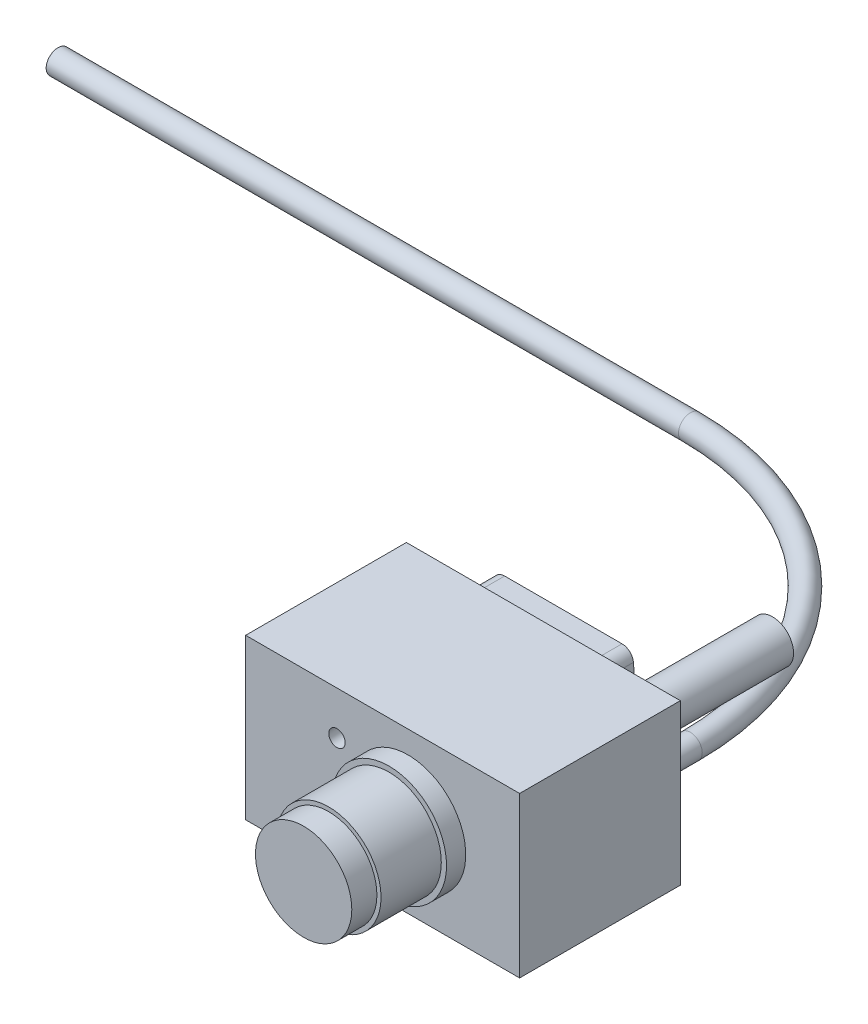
from build123d import *

# Parameters (mm, degrees)
SKETCH2_W           = 76.2
SKETCH2_H           = 44.704
BASE_EXTRUDE_DEPTH  = 22.225
SKETCH3_R           = 16.002
BOSS_EXTRUDE1_DEPTH = 5.334
SKETCH4_R           = 14.5415
BOSS_EXTRUDE2_DEPTH = 16.764
SKETCH6_R           = 13.3985
BOSS_EXTRUDE3_DEPTH = 6.985
BOSS_EXTRUDE4_DEPTH = 12.7
SKETCH15_R          = 6.35
EXTRUDE1_DEPTH      = 2.54
SKETCH8_R           = 3.302
SKETCH16_R          = 5.842
EXTRUDE2_DEPTH      = 35.56
SKETCH17_R          = 2.286
CUT_EXTRUDE1_DEPTH  = 12.7


with BuildPart() as part:
    # Sketch2 → Base-Extrude (new, symmetric)
    with BuildSketch(Plane(origin=(0, 0, 0), x_dir=(1, 0, 0), z_dir=(0, 1, 0))):
        Rectangle(SKETCH2_W, SKETCH2_H)
    extrude(amount=BASE_EXTRUDE_DEPTH, both=True)

    # Sketch3 → Boss-Extrude1 (add)
    with BuildSketch(Plane.XY.offset(22.352)):
        with Locations(Location((7.112, 0, 0), (0, 0, 180))):
            Circle(SKETCH3_R)
    extrude(amount=BOSS_EXTRUDE1_DEPTH)

    # Sketch4 → Boss-Extrude2 (add)
    with BuildSketch(Plane.XY.offset(27.686)):
        with Locations((7.112, 0)):
            Circle(SKETCH4_R)
    extrude(amount=BOSS_EXTRUDE2_DEPTH)

    # Sketch6 → Boss-Extrude3 (add)
    with BuildSketch(Plane.XY.offset(44.45)):
        with Locations((7.112, 0)):
            Circle(SKETCH6_R)
    extrude(amount=BOSS_EXTRUDE3_DEPTH)

    # Sketch7 → Boss-Extrude4 (add)
    with BuildSketch(Plane(origin=(0, 0, -22.352), x_dir=(-1, 0, 0), z_dir=(0, 0, -1))):
        with BuildLine():
            Line((-9.505308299, 5.0546), (23.792855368, 5.0546))
            ThreePointArc((23.792855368, 5.0546), (26.133710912, 6.084601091), (26.955773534, 8.506319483))
            Line((26.955773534, 8.506319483), (26.631330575, 12.214719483))
            ThreePointArc((26.631330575, 12.214719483), (25.613411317, 14.278855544), (23.468412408, 15.113))
            Line((23.468412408, 15.113), (-9.180865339, 15.113))
            ThreePointArc((-9.180865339, 15.113), (-11.325864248, 14.278855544), (-12.343783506, 12.214719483))
            Line((-12.343783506, 12.214719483), (-12.668226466, 8.506319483))
            ThreePointArc((-12.668226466, 8.506319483), (-11.846163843, 6.084601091), (-9.505308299, 5.0546))
        make_face()
    extrude(amount=BOSS_EXTRUDE4_DEPTH)

    # Sketch15 → Extrude1 (add)
    with BuildSketch(Plane(origin=(0, 0, -22.352), x_dir=(-1, 0, 0), z_dir=(0, 0, -1))):
        with Locations(Location((-28.194, 0, 0), (0, 0, 180))):
            Circle(SKETCH15_R)
    extrude(amount=EXTRUDE1_DEPTH)

    # Sweep1: sweep along a path in Sketch13
    with BuildLine(Plane(origin=(97.45548874, 0, 0), x_dir=(-1, 0, 0), z_dir=(0, 1, 0))) as sweep1_path:
        Line((69.26148874, -22.352), (69.26148874, -35.052))
        ThreePointArc((69.26148874, -35.052), (91.808185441, -89.484540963), (146.240726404, -112.031237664))
        Line((146.240726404, -112.031237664), (322.113884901, -112.031237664))
    # Sketch8 → Sweep1 (sweep)
    with BuildSketch(Plane(origin=(0, 0, -22.352), x_dir=(-1, 0, 0), z_dir=(0, 0, -1))):
        with Locations((-28.194, 0)):
            Circle(SKETCH8_R)
    sweep(path=sweep1_path.line)

    # Sketch16 → Extrude2 (add)
    with BuildSketch(Plane(origin=(0, 0, -22.352), x_dir=(-1, 0, 0), z_dir=(0, 0, -1))):
        with Locations(Location((-28.194, 13.843, 0), (0, 0, 180))):
            Circle(SKETCH16_R)
    extrude(amount=EXTRUDE2_DEPTH)

    # Sketch17 → Cut-Extrude1 (cut)
    with BuildSketch(Plane.XY.offset(22.352)):
        with Locations((-12.7, -10.16)):
            Circle(SKETCH17_R)
        with Locations((-12.7, 10.16)):
            Circle(SKETCH17_R)
    extrude(amount=-CUT_EXTRUDE1_DEPTH, mode=Mode.SUBTRACT)


solid = part.part
